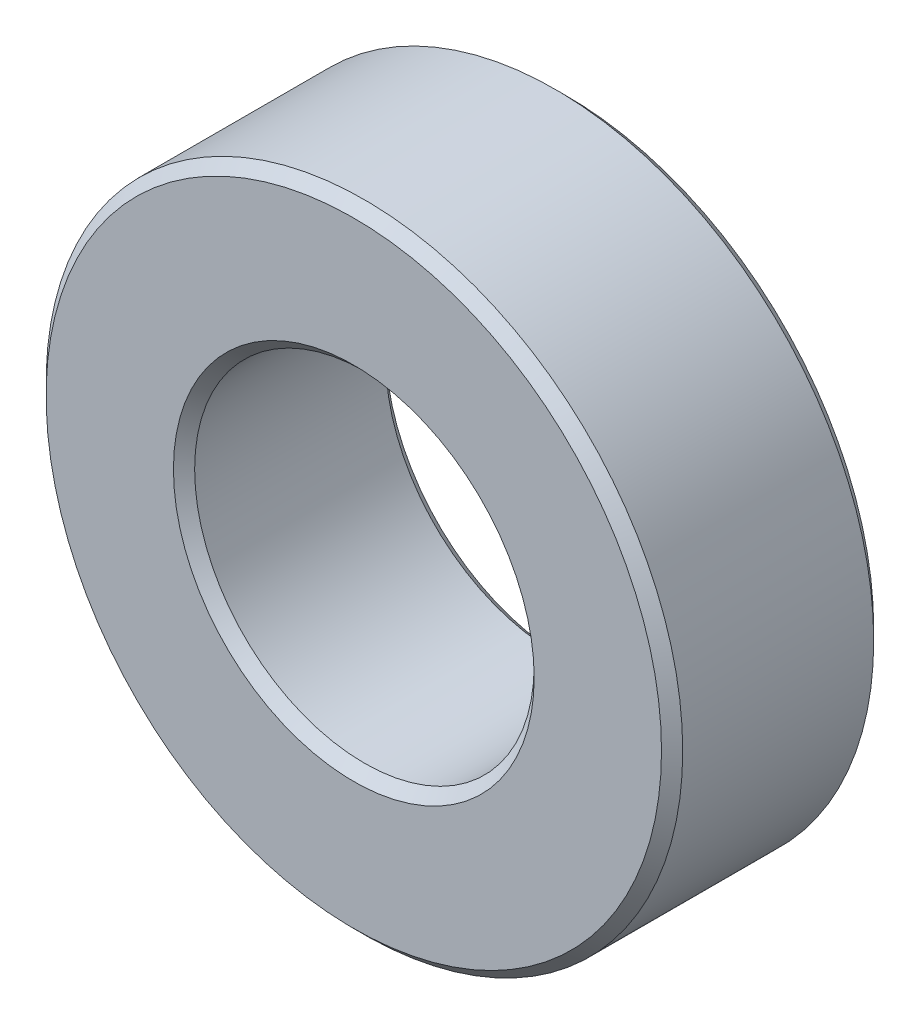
from build123d import *

# Parameters (mm, degrees)
SKETCH1_R           = 3
SKETCH1_R_2         = 1.6
BOSS_EXTRUDE2_DEPTH = 1
CHAMFER3_SIZE       = 0.1


with BuildPart() as part:
    # Sketch1 → Boss-Extrude2 (new, symmetric)
    with BuildSketch(Plane.XY):
        Circle(SKETCH1_R)
        Circle(SKETCH1_R_2, mode=Mode.SUBTRACT)
    extrude(amount=BOSS_EXTRUDE2_DEPTH, both=True)

    # Chamfer3
    chamfer3_edges = [part.edges().sort_by_distance(p)[0] for p in [
        (-3, 0, -1),
        (-3, 0, 1),
        (-1.6, 0, -1),
        (-1.6, 0, 1),
    ]]
    chamfer(chamfer3_edges, length=CHAMFER3_SIZE)


solid = part.part
